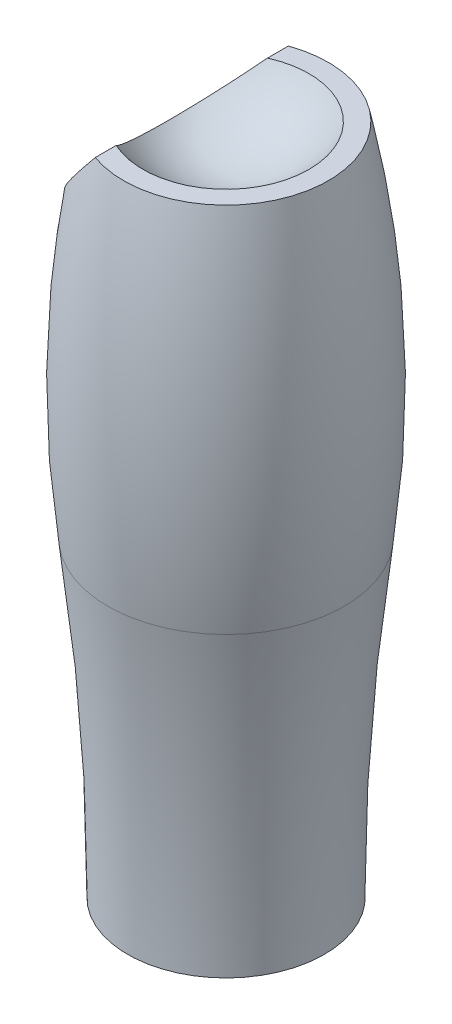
from build123d import *


with BuildPart() as part:
    # Skica1 → Oto_it kolem osy1 (revolve)
    with BuildSketch(Plane.XY, mode=Mode.PRIVATE) as oto_it_kolem_osy1_sk:
        with BuildLine():
            Line((0, 0), (0, 235.75))
            Line((0, 235.75), (35.9375, 235.75))
            ThreePointArc((35.9375, 235.75), (44.144116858, 172.7381741), (41.481315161, 109.25))
            ThreePointArc((41.481315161, 109.25), (36.24710692, 54.73641672), (34.5, 0))
            Line((34.5, 0), (0, 0))
        make_face()
    revolve(oto_it_kolem_osy1_sk.sketch.rotate(Axis((0, 0, 0), (0, 1, 0)), 90), axis=Axis((0, 0, 0), (0, 1, 0)))

    # Skica2 → Odebrat oto_en_m1 (revolve, cut)
    with BuildSketch(Plane.XY, mode=Mode.PRIVATE) as odebrat_oto_en_m1_sk:
        with BuildLine():
            Line((0, 219.75), (0, 254.25))
            Line((0, 254.25), (-34.5, 254.25))
            ThreePointArc((-34.5, 254.25), (-24.395183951, 229.854816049), (0, 219.75))
        make_face()
    revolve(odebrat_oto_en_m1_sk.sketch.rotate(Axis((0, 219.75, 0), (0, 1, 0)), 270), axis=Axis((0, 219.75, 0), (0, 1, 0)), mode=Mode.SUBTRACT)

    # Skica3 → Odebrat oto_en_m2 (revolve, cut)
    with BuildSketch(Plane.XY):
        with BuildLine():
            Line((0, -10), (0, 18.75))
            ThreePointArc((0, 18.75), (-20.329319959, 10.329319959), (-28.75, -10))
            Line((-28.75, -10), (0, -10))
        make_face()
    revolve(axis=Axis((0, -10, 0), (0, 1, 0)), mode=Mode.SUBTRACT)

    # Odebrat povrchem1
    split(bisect_by=Plane(origin=(-123.126102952, 103.315067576, 0), x_dir=(0, 0, 1), z_dir=(-0.7660444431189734, 0.6427876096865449, 0)), keep=Keep.BOTTOM)


solid = part.part
